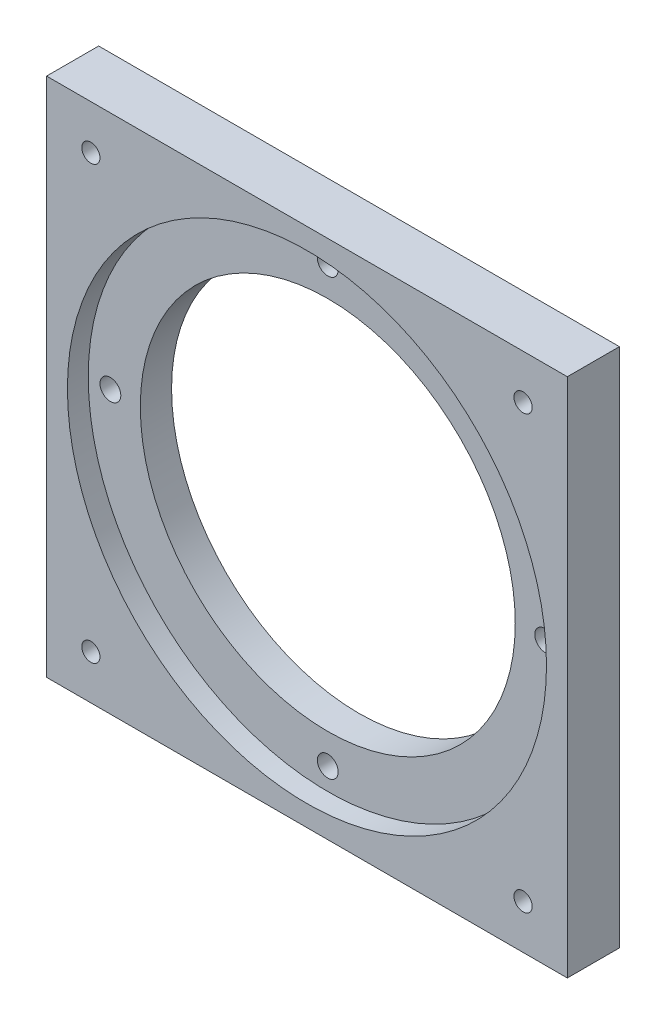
ISO-10303-21;
HEADER;
FILE_DESCRIPTION(('STEP AP214'),'2;1');
FILE_NAME('part.step','',(''),(''),'','','');
FILE_SCHEMA(('AUTOMOTIVE_DESIGN { 1 0 10303 214 1 1 1 1 }'));
ENDSEC;
DATA;
#1=APPLICATION_CONTEXT('core data for automotive mechanical design processes');
#2=APPLICATION_PROTOCOL_DEFINITION('international standard','automotive_design',2000,#1);
#3=PRODUCT_CONTEXT('',#1,'mechanical');
#4=PRODUCT('Part','Part','',(#3));
#5=PRODUCT_RELATED_PRODUCT_CATEGORY('part','',(#4));
#6=PRODUCT_DEFINITION_FORMATION('','',#4);
#7=PRODUCT_DEFINITION_CONTEXT('part definition',#1,'design');
#8=PRODUCT_DEFINITION('design','',#6,#7);
#9=PRODUCT_DEFINITION_SHAPE('','',#8);
#10=(LENGTH_UNIT() NAMED_UNIT(*) SI_UNIT(.MILLI.,.METRE.));
#11=(NAMED_UNIT(*) PLANE_ANGLE_UNIT() SI_UNIT($,.RADIAN.));
#12=(NAMED_UNIT(*) SI_UNIT($,.STERADIAN.) SOLID_ANGLE_UNIT());
#13=UNCERTAINTY_MEASURE_WITH_UNIT(LENGTH_MEASURE(1.E-05),#10,'distance_accuracy_value','');
#14=(GEOMETRIC_REPRESENTATION_CONTEXT(3) GLOBAL_UNCERTAINTY_ASSIGNED_CONTEXT((#13)) GLOBAL_UNIT_ASSIGNED_CONTEXT((#10,
#11,#12)) REPRESENTATION_CONTEXT('',''));
#15=CARTESIAN_POINT('',(0.,0.,0.));
#16=DIRECTION('',(0.,0.,1.));
#17=DIRECTION('',(1.,0.,0.));
#18=AXIS2_PLACEMENT_3D('',#15,#16,#17);
#19=CARTESIAN_POINT('',(50.,50.,10.));
#20=DIRECTION('',(0.,0.,-1.));
#21=DIRECTION('',(-1.,0.,0.));
#22=AXIS2_PLACEMENT_3D('',#19,#20,#21);
#23=CYLINDRICAL_SURFACE('',#22,36.);
#24=CARTESIAN_POINT('',(50.,50.,0.));
#25=DIRECTION('',(0.,0.,1.));
#26=DIRECTION('',(1.,0.,0.));
#27=AXIS2_PLACEMENT_3D('',#24,#25,#26);
#28=CIRCLE('',#27,36.);
#29=CARTESIAN_POINT('',(86.,50.,0.));
#30=VERTEX_POINT('',#29);
#31=EDGE_CURVE('E104',#30,#30,#28,.T.);
#32=ORIENTED_EDGE('',*,*,#31,.F.);
#33=EDGE_LOOP('',(#32));
#34=FACE_BOUND('',#33,.T.);
#35=CARTESIAN_POINT('',(50.,50.,6.));
#36=DIRECTION('',(0.,0.,1.));
#37=DIRECTION('',(1.,0.,0.));
#38=AXIS2_PLACEMENT_3D('',#35,#36,#37);
#39=CIRCLE('',#38,36.);
#40=CARTESIAN_POINT('',(86.,50.,6.));
#41=VERTEX_POINT('',#40);
#42=EDGE_CURVE('E39',#41,#41,#39,.T.);
#43=ORIENTED_EDGE('',*,*,#42,.T.);
#44=EDGE_LOOP('',(#43));
#45=FACE_BOUND('',#44,.T.);
#46=ADVANCED_FACE('F35',(#34,#45),#23,.F.);
#47=CARTESIAN_POINT('',(0.,0.,10.));
#48=DIRECTION('',(0.,0.,-1.));
#49=DIRECTION('',(-1.,0.,0.));
#50=AXIS2_PLACEMENT_3D('',#47,#48,#49);
#51=PLANE('',#50);
#52=CARTESIAN_POINT('',(91.5,8.5,10.));
#53=DIRECTION('',(0.,0.,1.));
#54=DIRECTION('',(1.,0.,0.));
#55=AXIS2_PLACEMENT_3D('',#52,#53,#54);
#56=CIRCLE('',#55,1.75);
#57=CARTESIAN_POINT('',(93.25,8.5,10.));
#58=VERTEX_POINT('',#57);
#59=EDGE_CURVE('E167',#58,#58,#56,.T.);
#60=ORIENTED_EDGE('',*,*,#59,.F.);
#61=EDGE_LOOP('',(#60));
#62=FACE_BOUND('',#61,.T.);
#63=CARTESIAN_POINT('',(8.50000000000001,8.5,10.));
#64=DIRECTION('',(0.,0.,1.));
#65=DIRECTION('',(1.,0.,0.));
#66=AXIS2_PLACEMENT_3D('',#63,#64,#65);
#67=CIRCLE('',#66,1.75);
#68=CARTESIAN_POINT('',(10.25,8.5,10.));
#69=VERTEX_POINT('',#68);
#70=EDGE_CURVE('E161',#69,#69,#67,.T.);
#71=ORIENTED_EDGE('',*,*,#70,.F.);
#72=EDGE_LOOP('',(#71));
#73=FACE_BOUND('',#72,.T.);
#74=CARTESIAN_POINT('',(91.5,91.5,10.));
#75=DIRECTION('',(0.,0.,1.));
#76=DIRECTION('',(1.,0.,0.));
#77=AXIS2_PLACEMENT_3D('',#74,#75,#76);
#78=CIRCLE('',#77,1.75);
#79=CARTESIAN_POINT('',(93.25,91.5,10.));
#80=VERTEX_POINT('',#79);
#81=EDGE_CURVE('E155',#80,#80,#78,.T.);
#82=ORIENTED_EDGE('',*,*,#81,.F.);
#83=EDGE_LOOP('',(#82));
#84=FACE_BOUND('',#83,.T.);
#85=CARTESIAN_POINT('',(8.50000000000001,91.5,10.));
#86=DIRECTION('',(0.,0.,1.));
#87=DIRECTION('',(1.,0.,0.));
#88=AXIS2_PLACEMENT_3D('',#85,#86,#87);
#89=CIRCLE('',#88,1.75);
#90=CARTESIAN_POINT('',(10.25,91.5,10.));
#91=VERTEX_POINT('',#90);
#92=EDGE_CURVE('E149',#91,#91,#89,.T.);
#93=ORIENTED_EDGE('',*,*,#92,.F.);
#94=EDGE_LOOP('',(#93));
#95=FACE_BOUND('',#94,.T.);
#96=CARTESIAN_POINT('',(50.,50.,10.));
#97=DIRECTION('',(0.,0.,1.));
#98=DIRECTION('',(1.,0.,0.));
#99=AXIS2_PLACEMENT_3D('',#96,#97,#98);
#100=CIRCLE('',#99,46.);
#101=CARTESIAN_POINT('',(96.,50.,10.));
#102=VERTEX_POINT('',#101);
#103=EDGE_CURVE('E118',#102,#102,#100,.T.);
#104=ORIENTED_EDGE('',*,*,#103,.F.);
#105=EDGE_LOOP('',(#104));
#106=FACE_BOUND('',#105,.T.);
#107=DIRECTION('',(0.,-1.,0.));
#108=VECTOR('',#107,1.);
#109=CARTESIAN_POINT('',(0.,0.,10.));
#110=LINE('',#109,#108);
#111=CARTESIAN_POINT('',(0.,100.,10.));
#112=VERTEX_POINT('',#111);
#113=CARTESIAN_POINT('',(0.,0.,10.));
#114=VERTEX_POINT('',#113);
#115=EDGE_CURVE('E88',#112,#114,#110,.T.);
#116=ORIENTED_EDGE('',*,*,#115,.T.);
#117=DIRECTION('',(1.,0.,0.));
#118=VECTOR('',#117,1.);
#119=CARTESIAN_POINT('',(0.,0.,10.));
#120=LINE('',#119,#118);
#121=CARTESIAN_POINT('',(100.,0.,10.));
#122=VERTEX_POINT('',#121);
#123=EDGE_CURVE('E83',#114,#122,#120,.T.);
#124=ORIENTED_EDGE('',*,*,#123,.T.);
#125=DIRECTION('',(0.,1.,0.));
#126=VECTOR('',#125,1.);
#127=CARTESIAN_POINT('',(100.,0.,10.));
#128=LINE('',#127,#126);
#129=CARTESIAN_POINT('',(100.,100.,10.));
#130=VERTEX_POINT('',#129);
#131=EDGE_CURVE('E86',#122,#130,#128,.T.);
#132=ORIENTED_EDGE('',*,*,#131,.T.);
#133=DIRECTION('',(-1.,0.,0.));
#134=VECTOR('',#133,1.);
#135=CARTESIAN_POINT('',(0.,100.,10.));
#136=LINE('',#135,#134);
#137=EDGE_CURVE('E53',#130,#112,#136,.T.);
#138=ORIENTED_EDGE('',*,*,#137,.T.);
#139=EDGE_LOOP('',(#116,#124,#132,#138));
#140=FACE_BOUND('',#139,.T.);
#141=ADVANCED_FACE('F84',(#62,#73,#84,#95,#106,#140),#51,.F.);
#142=CARTESIAN_POINT('',(0.,0.,0.));
#143=DIRECTION('',(0.,0.,-1.));
#144=DIRECTION('',(-1.,0.,0.));
#145=AXIS2_PLACEMENT_3D('',#142,#143,#144);
#146=PLANE('',#145);
#147=CARTESIAN_POINT('',(50.,8.25000000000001,0.));
#148=DIRECTION('',(0.,0.,1.));
#149=DIRECTION('',(1.,0.,0.));
#150=AXIS2_PLACEMENT_3D('',#147,#148,#149);
#151=CIRCLE('',#150,2.);
#152=CARTESIAN_POINT('',(52.,8.25000000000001,0.));
#153=VERTEX_POINT('',#152);
#154=EDGE_CURVE('E140',#153,#153,#151,.T.);
#155=ORIENTED_EDGE('',*,*,#154,.T.);
#156=EDGE_LOOP('',(#155));
#157=FACE_BOUND('',#156,.T.);
#158=CARTESIAN_POINT('',(91.75,50.,0.));
#159=DIRECTION('',(0.,0.,1.));
#160=DIRECTION('',(1.,0.,0.));
#161=AXIS2_PLACEMENT_3D('',#158,#159,#160);
#162=CIRCLE('',#161,2.);
#163=CARTESIAN_POINT('',(93.75,50.,0.));
#164=VERTEX_POINT('',#163);
#165=EDGE_CURVE('E134',#164,#164,#162,.T.);
#166=ORIENTED_EDGE('',*,*,#165,.T.);
#167=EDGE_LOOP('',(#166));
#168=FACE_BOUND('',#167,.T.);
#169=CARTESIAN_POINT('',(50.,91.75,0.));
#170=DIRECTION('',(0.,0.,1.));
#171=DIRECTION('',(1.,0.,0.));
#172=AXIS2_PLACEMENT_3D('',#169,#170,#171);
#173=CIRCLE('',#172,2.);
#174=CARTESIAN_POINT('',(52.,91.75,0.));
#175=VERTEX_POINT('',#174);
#176=EDGE_CURVE('E128',#175,#175,#173,.T.);
#177=ORIENTED_EDGE('',*,*,#176,.T.);
#178=EDGE_LOOP('',(#177));
#179=FACE_BOUND('',#178,.T.);
#180=CARTESIAN_POINT('',(8.25000000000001,50.,0.));
#181=DIRECTION('',(0.,0.,1.));
#182=DIRECTION('',(1.,0.,0.));
#183=AXIS2_PLACEMENT_3D('',#180,#181,#182);
#184=CIRCLE('',#183,2.);
#185=CARTESIAN_POINT('',(10.25,50.,0.));
#186=VERTEX_POINT('',#185);
#187=EDGE_CURVE('E122',#186,#186,#184,.T.);
#188=ORIENTED_EDGE('',*,*,#187,.T.);
#189=EDGE_LOOP('',(#188));
#190=FACE_BOUND('',#189,.T.);
#191=DIRECTION('',(0.,-1.,0.));
#192=VECTOR('',#191,1.);
#193=CARTESIAN_POINT('',(0.,0.,0.));
#194=LINE('',#193,#192);
#195=CARTESIAN_POINT('',(0.,100.,0.));
#196=VERTEX_POINT('',#195);
#197=CARTESIAN_POINT('',(0.,0.,0.));
#198=VERTEX_POINT('',#197);
#199=EDGE_CURVE('E101',#196,#198,#194,.T.);
#200=ORIENTED_EDGE('',*,*,#199,.F.);
#201=DIRECTION('',(-1.,0.,0.));
#202=VECTOR('',#201,1.);
#203=CARTESIAN_POINT('',(0.,100.,0.));
#204=LINE('',#203,#202);
#205=CARTESIAN_POINT('',(100.,100.,0.));
#206=VERTEX_POINT('',#205);
#207=EDGE_CURVE('E76',#206,#196,#204,.T.);
#208=ORIENTED_EDGE('',*,*,#207,.F.);
#209=DIRECTION('',(0.,1.,0.));
#210=VECTOR('',#209,1.);
#211=CARTESIAN_POINT('',(100.,0.,0.));
#212=LINE('',#211,#210);
#213=CARTESIAN_POINT('',(100.,0.,0.));
#214=VERTEX_POINT('',#213);
#215=EDGE_CURVE('E70',#214,#206,#212,.T.);
#216=ORIENTED_EDGE('',*,*,#215,.F.);
#217=DIRECTION('',(1.,0.,0.));
#218=VECTOR('',#217,1.);
#219=CARTESIAN_POINT('',(0.,0.,0.));
#220=LINE('',#219,#218);
#221=EDGE_CURVE('E92',#198,#214,#220,.T.);
#222=ORIENTED_EDGE('',*,*,#221,.F.);
#223=EDGE_LOOP('',(#200,#208,#216,#222));
#224=FACE_BOUND('',#223,.T.);
#225=ORIENTED_EDGE('',*,*,#31,.T.);
#226=EDGE_LOOP('',(#225));
#227=FACE_BOUND('',#226,.T.);
#228=ADVANCED_FACE('F112',(#157,#168,#179,#190,#224,#227),#146,.T.);
#229=CARTESIAN_POINT('',(0.,0.,10.));
#230=DIRECTION('',(1.,0.,0.));
#231=DIRECTION('',(0.,0.,-1.));
#232=AXIS2_PLACEMENT_3D('',#229,#230,#231);
#233=PLANE('',#232);
#234=ORIENTED_EDGE('',*,*,#199,.T.);
#235=DIRECTION('',(0.,0.,-1.));
#236=VECTOR('',#235,1.);
#237=CARTESIAN_POINT('',(0.,0.,10.));
#238=LINE('',#237,#236);
#239=EDGE_CURVE('E11',#114,#198,#238,.T.);
#240=ORIENTED_EDGE('',*,*,#239,.F.);
#241=ORIENTED_EDGE('',*,*,#115,.F.);
#242=DIRECTION('',(0.,0.,-1.));
#243=VECTOR('',#242,1.);
#244=CARTESIAN_POINT('',(0.,100.,10.));
#245=LINE('',#244,#243);
#246=EDGE_CURVE('E97',#112,#196,#245,.T.);
#247=ORIENTED_EDGE('',*,*,#246,.T.);
#248=EDGE_LOOP('',(#234,#240,#241,#247));
#249=FACE_BOUND('',#248,.T.);
#250=ADVANCED_FACE('F37',(#249),#233,.F.);
#251=CARTESIAN_POINT('',(0.,0.,10.));
#252=DIRECTION('',(0.,1.,0.));
#253=DIRECTION('',(0.,0.,1.));
#254=AXIS2_PLACEMENT_3D('',#251,#252,#253);
#255=PLANE('',#254);
#256=ORIENTED_EDGE('',*,*,#221,.T.);
#257=DIRECTION('',(0.,0.,-1.));
#258=VECTOR('',#257,1.);
#259=CARTESIAN_POINT('',(100.,0.,10.));
#260=LINE('',#259,#258);
#261=EDGE_CURVE('E45',#122,#214,#260,.T.);
#262=ORIENTED_EDGE('',*,*,#261,.F.);
#263=ORIENTED_EDGE('',*,*,#123,.F.);
#264=ORIENTED_EDGE('',*,*,#239,.T.);
#265=EDGE_LOOP('',(#256,#262,#263,#264));
#266=FACE_BOUND('',#265,.T.);
#267=ADVANCED_FACE('F91',(#266),#255,.F.);
#268=CARTESIAN_POINT('',(100.,0.,10.));
#269=DIRECTION('',(-1.,0.,0.));
#270=DIRECTION('',(0.,0.,1.));
#271=AXIS2_PLACEMENT_3D('',#268,#269,#270);
#272=PLANE('',#271);
#273=ORIENTED_EDGE('',*,*,#215,.T.);
#274=DIRECTION('',(0.,0.,-1.));
#275=VECTOR('',#274,1.);
#276=CARTESIAN_POINT('',(100.,100.,10.));
#277=LINE('',#276,#275);
#278=EDGE_CURVE('E93',#130,#206,#277,.T.);
#279=ORIENTED_EDGE('',*,*,#278,.F.);
#280=ORIENTED_EDGE('',*,*,#131,.F.);
#281=ORIENTED_EDGE('',*,*,#261,.T.);
#282=EDGE_LOOP('',(#273,#279,#280,#281));
#283=FACE_BOUND('',#282,.T.);
#284=ADVANCED_FACE('F95',(#283),#272,.F.);
#285=CARTESIAN_POINT('',(0.,100.,10.));
#286=DIRECTION('',(0.,-1.,0.));
#287=DIRECTION('',(0.,0.,-1.));
#288=AXIS2_PLACEMENT_3D('',#285,#286,#287);
#289=PLANE('',#288);
#290=ORIENTED_EDGE('',*,*,#207,.T.);
#291=ORIENTED_EDGE('',*,*,#246,.F.);
#292=ORIENTED_EDGE('',*,*,#137,.F.);
#293=ORIENTED_EDGE('',*,*,#278,.T.);
#294=EDGE_LOOP('',(#290,#291,#292,#293));
#295=FACE_BOUND('',#294,.T.);
#296=ADVANCED_FACE('F109',(#295),#289,.F.);
#297=CARTESIAN_POINT('',(50.,50.,6.));
#298=DIRECTION('',(0.,0.,1.));
#299=DIRECTION('',(1.,0.,0.));
#300=AXIS2_PLACEMENT_3D('',#297,#298,#299);
#301=CYLINDRICAL_SURFACE('',#300,46.);
#302=CARTESIAN_POINT('',(50.,50.,6.));
#303=DIRECTION('',(0.,0.,1.));
#304=DIRECTION('',(1.,0.,0.));
#305=AXIS2_PLACEMENT_3D('',#302,#303,#304);
#306=CIRCLE('',#305,46.);
#307=CARTESIAN_POINT('',(96.,50.,6.));
#308=VERTEX_POINT('',#307);
#309=EDGE_CURVE('E121',#308,#308,#306,.T.);
#310=ORIENTED_EDGE('',*,*,#309,.F.);
#311=EDGE_LOOP('',(#310));
#312=FACE_BOUND('',#311,.T.);
#313=ORIENTED_EDGE('',*,*,#103,.T.);
#314=EDGE_LOOP('',(#313));
#315=FACE_BOUND('',#314,.T.);
#316=ADVANCED_FACE('F193',(#312,#315),#301,.F.);
#317=CARTESIAN_POINT('',(50.,50.,6.));
#318=DIRECTION('',(0.,0.,1.));
#319=DIRECTION('',(1.,0.,0.));
#320=AXIS2_PLACEMENT_3D('',#317,#318,#319);
#321=PLANE('',#320);
#322=CARTESIAN_POINT('',(50.,8.25000000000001,6.));
#323=DIRECTION('',(0.,0.,1.));
#324=DIRECTION('',(1.,0.,0.));
#325=AXIS2_PLACEMENT_3D('',#322,#323,#324);
#326=CIRCLE('',#325,2.);
#327=CARTESIAN_POINT('',(52.,8.25000000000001,6.));
#328=VERTEX_POINT('',#327);
#329=EDGE_CURVE('E143',#328,#328,#326,.T.);
#330=ORIENTED_EDGE('',*,*,#329,.F.);
#331=EDGE_LOOP('',(#330));
#332=FACE_BOUND('',#331,.T.);
#333=CARTESIAN_POINT('',(91.75,50.,6.));
#334=DIRECTION('',(0.,0.,1.));
#335=DIRECTION('',(1.,0.,0.));
#336=AXIS2_PLACEMENT_3D('',#333,#334,#335);
#337=CIRCLE('',#336,2.);
#338=CARTESIAN_POINT('',(93.75,50.,6.));
#339=VERTEX_POINT('',#338);
#340=EDGE_CURVE('E137',#339,#339,#337,.T.);
#341=ORIENTED_EDGE('',*,*,#340,.F.);
#342=EDGE_LOOP('',(#341));
#343=FACE_BOUND('',#342,.T.);
#344=CARTESIAN_POINT('',(50.,91.75,6.));
#345=DIRECTION('',(0.,0.,1.));
#346=DIRECTION('',(1.,0.,0.));
#347=AXIS2_PLACEMENT_3D('',#344,#345,#346);
#348=CIRCLE('',#347,2.);
#349=CARTESIAN_POINT('',(52.,91.75,6.));
#350=VERTEX_POINT('',#349);
#351=EDGE_CURVE('E131',#350,#350,#348,.T.);
#352=ORIENTED_EDGE('',*,*,#351,.F.);
#353=EDGE_LOOP('',(#352));
#354=FACE_BOUND('',#353,.T.);
#355=CARTESIAN_POINT('',(8.25000000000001,50.,6.));
#356=DIRECTION('',(0.,0.,1.));
#357=DIRECTION('',(1.,0.,0.));
#358=AXIS2_PLACEMENT_3D('',#355,#356,#357);
#359=CIRCLE('',#358,2.);
#360=CARTESIAN_POINT('',(10.25,50.,6.));
#361=VERTEX_POINT('',#360);
#362=EDGE_CURVE('E125',#361,#361,#359,.T.);
#363=ORIENTED_EDGE('',*,*,#362,.F.);
#364=EDGE_LOOP('',(#363));
#365=FACE_BOUND('',#364,.T.);
#366=ORIENTED_EDGE('',*,*,#42,.F.);
#367=EDGE_LOOP('',(#366));
#368=FACE_BOUND('',#367,.T.);
#369=ORIENTED_EDGE('',*,*,#309,.T.);
#370=EDGE_LOOP('',(#369));
#371=FACE_BOUND('',#370,.T.);
#372=ADVANCED_FACE('F195',(#332,#343,#354,#365,#368,#371),#321,.T.);
#373=CARTESIAN_POINT('',(8.25000000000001,50.,0.));
#374=DIRECTION('',(0.,0.,1.));
#375=DIRECTION('',(1.,0.,0.));
#376=AXIS2_PLACEMENT_3D('',#373,#374,#375);
#377=CYLINDRICAL_SURFACE('',#376,2.);
#378=ORIENTED_EDGE('',*,*,#187,.F.);
#379=EDGE_LOOP('',(#378));
#380=FACE_BOUND('',#379,.T.);
#381=ORIENTED_EDGE('',*,*,#362,.T.);
#382=EDGE_LOOP('',(#381));
#383=FACE_BOUND('',#382,.T.);
#384=ADVANCED_FACE('F202',(#380,#383),#377,.F.);
#385=CARTESIAN_POINT('',(50.,91.75,0.));
#386=DIRECTION('',(0.,0.,1.));
#387=DIRECTION('',(1.,0.,0.));
#388=AXIS2_PLACEMENT_3D('',#385,#386,#387);
#389=CYLINDRICAL_SURFACE('',#388,2.);
#390=ORIENTED_EDGE('',*,*,#176,.F.);
#391=EDGE_LOOP('',(#390));
#392=FACE_BOUND('',#391,.T.);
#393=ORIENTED_EDGE('',*,*,#351,.T.);
#394=EDGE_LOOP('',(#393));
#395=FACE_BOUND('',#394,.T.);
#396=ADVANCED_FACE('F323',(#392,#395),#389,.F.);
#397=CARTESIAN_POINT('',(91.75,50.,0.));
#398=DIRECTION('',(0.,0.,1.));
#399=DIRECTION('',(1.,0.,0.));
#400=AXIS2_PLACEMENT_3D('',#397,#398,#399);
#401=CYLINDRICAL_SURFACE('',#400,2.);
#402=ORIENTED_EDGE('',*,*,#165,.F.);
#403=EDGE_LOOP('',(#402));
#404=FACE_BOUND('',#403,.T.);
#405=ORIENTED_EDGE('',*,*,#340,.T.);
#406=EDGE_LOOP('',(#405));
#407=FACE_BOUND('',#406,.T.);
#408=ADVANCED_FACE('F319',(#404,#407),#401,.F.);
#409=CARTESIAN_POINT('',(50.,8.25000000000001,0.));
#410=DIRECTION('',(0.,0.,1.));
#411=DIRECTION('',(1.,0.,0.));
#412=AXIS2_PLACEMENT_3D('',#409,#410,#411);
#413=CYLINDRICAL_SURFACE('',#412,2.);
#414=ORIENTED_EDGE('',*,*,#154,.F.);
#415=EDGE_LOOP('',(#414));
#416=FACE_BOUND('',#415,.T.);
#417=ORIENTED_EDGE('',*,*,#329,.T.);
#418=EDGE_LOOP('',(#417));
#419=FACE_BOUND('',#418,.T.);
#420=ADVANCED_FACE('F240',(#416,#419),#413,.F.);
#421=CARTESIAN_POINT('',(8.50000000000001,91.5,2.));
#422=DIRECTION('',(0.,0.,1.));
#423=DIRECTION('',(1.,0.,0.));
#424=AXIS2_PLACEMENT_3D('',#421,#422,#423);
#425=CYLINDRICAL_SURFACE('',#424,1.75);
#426=CARTESIAN_POINT('',(8.50000000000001,91.5,2.));
#427=DIRECTION('',(0.,0.,1.));
#428=DIRECTION('',(1.,0.,0.));
#429=AXIS2_PLACEMENT_3D('',#426,#427,#428);
#430=CIRCLE('',#429,1.75);
#431=CARTESIAN_POINT('',(10.25,91.5,2.));
#432=VERTEX_POINT('',#431);
#433=EDGE_CURVE('E146',#432,#432,#430,.T.);
#434=ORIENTED_EDGE('',*,*,#433,.F.);
#435=EDGE_LOOP('',(#434));
#436=FACE_BOUND('',#435,.T.);
#437=ORIENTED_EDGE('',*,*,#92,.T.);
#438=EDGE_LOOP('',(#437));
#439=FACE_BOUND('',#438,.T.);
#440=ADVANCED_FACE('F245',(#436,#439),#425,.F.);
#441=CARTESIAN_POINT('',(8.50000000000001,91.5,2.));
#442=DIRECTION('',(0.,0.,1.));
#443=DIRECTION('',(1.,0.,0.));
#444=AXIS2_PLACEMENT_3D('',#441,#442,#443);
#445=PLANE('',#444);
#446=ORIENTED_EDGE('',*,*,#433,.T.);
#447=EDGE_LOOP('',(#446));
#448=FACE_BOUND('',#447,.T.);
#449=ADVANCED_FACE('F250',(#448),#445,.T.);
#450=CARTESIAN_POINT('',(91.5,91.5,2.));
#451=DIRECTION('',(0.,0.,1.));
#452=DIRECTION('',(1.,0.,0.));
#453=AXIS2_PLACEMENT_3D('',#450,#451,#452);
#454=CYLINDRICAL_SURFACE('',#453,1.75);
#455=CARTESIAN_POINT('',(91.5,91.5,2.));
#456=DIRECTION('',(0.,0.,1.));
#457=DIRECTION('',(1.,0.,0.));
#458=AXIS2_PLACEMENT_3D('',#455,#456,#457);
#459=CIRCLE('',#458,1.75);
#460=CARTESIAN_POINT('',(93.25,91.5,2.));
#461=VERTEX_POINT('',#460);
#462=EDGE_CURVE('E152',#461,#461,#459,.T.);
#463=ORIENTED_EDGE('',*,*,#462,.F.);
#464=EDGE_LOOP('',(#463));
#465=FACE_BOUND('',#464,.T.);
#466=ORIENTED_EDGE('',*,*,#81,.T.);
#467=EDGE_LOOP('',(#466));
#468=FACE_BOUND('',#467,.T.);
#469=ADVANCED_FACE('F260',(#465,#468),#454,.F.);
#470=CARTESIAN_POINT('',(91.5,91.5,2.));
#471=DIRECTION('',(0.,0.,1.));
#472=DIRECTION('',(1.,0.,0.));
#473=AXIS2_PLACEMENT_3D('',#470,#471,#472);
#474=PLANE('',#473);
#475=ORIENTED_EDGE('',*,*,#462,.T.);
#476=EDGE_LOOP('',(#475));
#477=FACE_BOUND('',#476,.T.);
#478=ADVANCED_FACE('F270',(#477),#474,.T.);
#479=CARTESIAN_POINT('',(8.50000000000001,8.5,2.));
#480=DIRECTION('',(0.,0.,1.));
#481=DIRECTION('',(1.,0.,0.));
#482=AXIS2_PLACEMENT_3D('',#479,#480,#481);
#483=CYLINDRICAL_SURFACE('',#482,1.75);
#484=CARTESIAN_POINT('',(8.50000000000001,8.5,2.));
#485=DIRECTION('',(0.,0.,1.));
#486=DIRECTION('',(1.,0.,0.));
#487=AXIS2_PLACEMENT_3D('',#484,#485,#486);
#488=CIRCLE('',#487,1.75);
#489=CARTESIAN_POINT('',(10.25,8.5,2.));
#490=VERTEX_POINT('',#489);
#491=EDGE_CURVE('E158',#490,#490,#488,.T.);
#492=ORIENTED_EDGE('',*,*,#491,.F.);
#493=EDGE_LOOP('',(#492));
#494=FACE_BOUND('',#493,.T.);
#495=ORIENTED_EDGE('',*,*,#70,.T.);
#496=EDGE_LOOP('',(#495));
#497=FACE_BOUND('',#496,.T.);
#498=ADVANCED_FACE('F280',(#494,#497),#483,.F.);
#499=CARTESIAN_POINT('',(8.50000000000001,8.5,2.));
#500=DIRECTION('',(0.,0.,1.));
#501=DIRECTION('',(1.,0.,0.));
#502=AXIS2_PLACEMENT_3D('',#499,#500,#501);
#503=PLANE('',#502);
#504=ORIENTED_EDGE('',*,*,#491,.T.);
#505=EDGE_LOOP('',(#504));
#506=FACE_BOUND('',#505,.T.);
#507=ADVANCED_FACE('F178',(#506),#503,.T.);
#508=CARTESIAN_POINT('',(91.5,8.5,2.));
#509=DIRECTION('',(0.,0.,1.));
#510=DIRECTION('',(1.,0.,0.));
#511=AXIS2_PLACEMENT_3D('',#508,#509,#510);
#512=CYLINDRICAL_SURFACE('',#511,1.75);
#513=CARTESIAN_POINT('',(91.5,8.5,2.));
#514=DIRECTION('',(0.,0.,1.));
#515=DIRECTION('',(1.,0.,0.));
#516=AXIS2_PLACEMENT_3D('',#513,#514,#515);
#517=CIRCLE('',#516,1.75);
#518=CARTESIAN_POINT('',(93.25,8.5,2.));
#519=VERTEX_POINT('',#518);
#520=EDGE_CURVE('E164',#519,#519,#517,.T.);
#521=ORIENTED_EDGE('',*,*,#520,.F.);
#522=EDGE_LOOP('',(#521));
#523=FACE_BOUND('',#522,.T.);
#524=ORIENTED_EDGE('',*,*,#59,.T.);
#525=EDGE_LOOP('',(#524));
#526=FACE_BOUND('',#525,.T.);
#527=ADVANCED_FACE('F175',(#523,#526),#512,.F.);
#528=CARTESIAN_POINT('',(91.5,8.5,2.));
#529=DIRECTION('',(0.,0.,1.));
#530=DIRECTION('',(1.,0.,0.));
#531=AXIS2_PLACEMENT_3D('',#528,#529,#530);
#532=PLANE('',#531);
#533=ORIENTED_EDGE('',*,*,#520,.T.);
#534=EDGE_LOOP('',(#533));
#535=FACE_BOUND('',#534,.T.);
#536=ADVANCED_FACE('F173',(#535),#532,.T.);
#537=CLOSED_SHELL('',(#46,#141,#228,#250,#267,#284,#296,#316,#372,#384,#396,#408,#420,#440,#449,
#469,#478,#498,#507,#527,#536));
#538=MANIFOLD_SOLID_BREP('B2',#537);
#539=ADVANCED_BREP_SHAPE_REPRESENTATION('',(#18,#538),#14);
#540=SHAPE_DEFINITION_REPRESENTATION(#9,#539);
ENDSEC;
END-ISO-10303-21;
